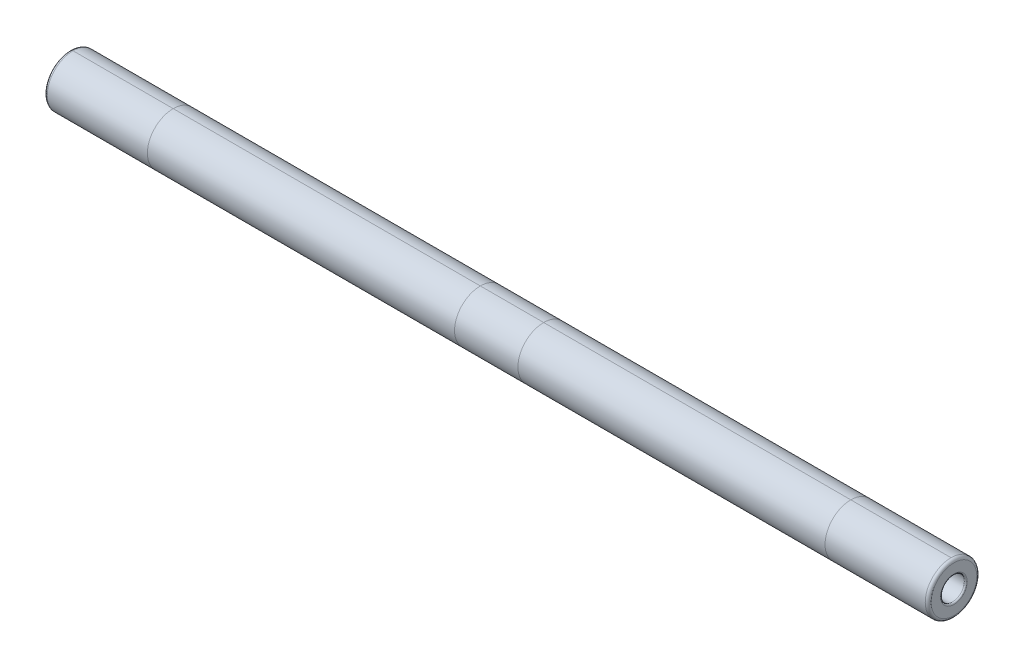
ISO-10303-21;
HEADER;
FILE_DESCRIPTION(('STEP AP214'),'2;1');
FILE_NAME('part.step','',(''),(''),'','','');
FILE_SCHEMA(('AUTOMOTIVE_DESIGN { 1 0 10303 214 1 1 1 1 }'));
ENDSEC;
DATA;
#1=APPLICATION_CONTEXT('core data for automotive mechanical design processes');
#2=APPLICATION_PROTOCOL_DEFINITION('international standard','automotive_design',2000,#1);
#3=PRODUCT_CONTEXT('',#1,'mechanical');
#4=PRODUCT('Part','Part','',(#3));
#5=PRODUCT_RELATED_PRODUCT_CATEGORY('part','',(#4));
#6=PRODUCT_DEFINITION_FORMATION('','',#4);
#7=PRODUCT_DEFINITION_CONTEXT('part definition',#1,'design');
#8=PRODUCT_DEFINITION('design','',#6,#7);
#9=PRODUCT_DEFINITION_SHAPE('','',#8);
#10=(LENGTH_UNIT() NAMED_UNIT(*) SI_UNIT(.MILLI.,.METRE.));
#11=(NAMED_UNIT(*) PLANE_ANGLE_UNIT() SI_UNIT($,.RADIAN.));
#12=(NAMED_UNIT(*) SI_UNIT($,.STERADIAN.) SOLID_ANGLE_UNIT());
#13=UNCERTAINTY_MEASURE_WITH_UNIT(LENGTH_MEASURE(1.E-05),#10,'distance_accuracy_value','');
#14=(GEOMETRIC_REPRESENTATION_CONTEXT(3) GLOBAL_UNCERTAINTY_ASSIGNED_CONTEXT((#13)) GLOBAL_UNIT_ASSIGNED_CONTEXT((#10,
#11,#12)) REPRESENTATION_CONTEXT('',''));
#15=CARTESIAN_POINT('',(0.,0.,0.));
#16=DIRECTION('',(0.,0.,1.));
#17=DIRECTION('',(1.,0.,0.));
#18=AXIS2_PLACEMENT_3D('',#15,#16,#17);
#19=CARTESIAN_POINT('',(-300.,0.,0.));
#20=DIRECTION('',(-1.,0.,0.));
#21=DIRECTION('',(0.,-1.,0.));
#22=AXIS2_PLACEMENT_3D('',#19,#20,#21);
#23=CYLINDRICAL_SURFACE('',#22,17.5);
#24=CARTESIAN_POINT('',(21.5,0.,0.));
#25=DIRECTION('',(-1.,0.,0.));
#26=DIRECTION('',(0.,-1.,0.));
#27=AXIS2_PLACEMENT_3D('',#24,#25,#26);
#28=CIRCLE('',#27,17.5);
#29=CARTESIAN_POINT('',(21.5,-17.4999999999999,0.));
#30=VERTEX_POINT('',#29);
#31=CARTESIAN_POINT('',(21.5,17.5000000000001,0.));
#32=VERTEX_POINT('',#31);
#33=EDGE_CURVE('E58',#30,#32,#28,.T.);
#34=ORIENTED_EDGE('',*,*,#33,.F.);
#35=DIRECTION('',(-1.,0.,0.));
#36=VECTOR('',#35,1.);
#37=CARTESIAN_POINT('',(-300.,-17.5,0.));
#38=LINE('',#37,#36);
#39=CARTESIAN_POINT('',(230.,-17.4999999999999,0.));
#40=VERTEX_POINT('',#39);
#41=EDGE_CURVE('E144',#40,#30,#38,.T.);
#42=ORIENTED_EDGE('',*,*,#41,.F.);
#43=CARTESIAN_POINT('',(230.,0.,0.));
#44=DIRECTION('',(1.,0.,0.));
#45=DIRECTION('',(0.,0.,-1.));
#46=AXIS2_PLACEMENT_3D('',#43,#44,#45);
#47=CIRCLE('',#46,17.5);
#48=CARTESIAN_POINT('',(230.,17.5000000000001,0.));
#49=VERTEX_POINT('',#48);
#50=EDGE_CURVE('E151',#49,#40,#47,.T.);
#51=ORIENTED_EDGE('',*,*,#50,.F.);
#52=DIRECTION('',(-1.,0.,0.));
#53=VECTOR('',#52,1.);
#54=CARTESIAN_POINT('',(-300.,17.5,0.));
#55=LINE('',#54,#53);
#56=EDGE_CURVE('E113',#49,#32,#55,.T.);
#57=ORIENTED_EDGE('',*,*,#56,.T.);
#58=EDGE_LOOP('',(#34,#42,#51,#57));
#59=FACE_BOUND('',#58,.T.);
#60=ADVANCED_FACE('F43',(#59),#23,.T.);
#61=CARTESIAN_POINT('',(21.5,0.,0.));
#62=DIRECTION('',(-1.,0.,0.));
#63=DIRECTION('',(0.,-1.,0.));
#64=AXIS2_PLACEMENT_3D('',#61,#62,#63);
#65=CIRCLE('',#64,17.5);
#66=EDGE_CURVE('E162',#32,#30,#65,.T.);
#67=ORIENTED_EDGE('',*,*,#66,.F.);
#68=ORIENTED_EDGE('',*,*,#56,.F.);
#69=CARTESIAN_POINT('',(230.,0.,0.));
#70=DIRECTION('',(1.,0.,0.));
#71=DIRECTION('',(0.,0.,-1.));
#72=AXIS2_PLACEMENT_3D('',#69,#70,#71);
#73=CIRCLE('',#72,17.5);
#74=EDGE_CURVE('E148',#40,#49,#73,.T.);
#75=ORIENTED_EDGE('',*,*,#74,.F.);
#76=ORIENTED_EDGE('',*,*,#41,.T.);
#77=EDGE_LOOP('',(#67,#68,#75,#76));
#78=FACE_BOUND('',#77,.T.);
#79=ADVANCED_FACE('F191',(#78),#23,.T.);
#80=CARTESIAN_POINT('',(-21.5,-17.5,0.));
#81=VERTEX_POINT('',#80);
#82=EDGE_CURVE('E145',#30,#81,#38,.T.);
#83=ORIENTED_EDGE('',*,*,#82,.F.);
#84=ORIENTED_EDGE('',*,*,#33,.T.);
#85=CARTESIAN_POINT('',(-21.5,17.5000000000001,0.));
#86=VERTEX_POINT('',#85);
#87=EDGE_CURVE('E138',#32,#86,#55,.T.);
#88=ORIENTED_EDGE('',*,*,#87,.T.);
#89=CARTESIAN_POINT('',(-21.5,0.,0.));
#90=DIRECTION('',(-1.,0.,0.));
#91=DIRECTION('',(0.,-1.,0.));
#92=AXIS2_PLACEMENT_3D('',#89,#90,#91);
#93=CIRCLE('',#92,17.5);
#94=EDGE_CURVE('E158',#81,#86,#93,.T.);
#95=ORIENTED_EDGE('',*,*,#94,.F.);
#96=EDGE_LOOP('',(#83,#84,#88,#95));
#97=FACE_BOUND('',#96,.T.);
#98=ADVANCED_FACE('F197',(#97),#23,.T.);
#99=ORIENTED_EDGE('',*,*,#87,.F.);
#100=ORIENTED_EDGE('',*,*,#66,.T.);
#101=ORIENTED_EDGE('',*,*,#82,.T.);
#102=CARTESIAN_POINT('',(-21.5,0.,0.));
#103=DIRECTION('',(-1.,0.,0.));
#104=DIRECTION('',(0.,-1.,0.));
#105=AXIS2_PLACEMENT_3D('',#102,#103,#104);
#106=CIRCLE('',#105,17.5);
#107=EDGE_CURVE('E154',#86,#81,#106,.T.);
#108=ORIENTED_EDGE('',*,*,#107,.F.);
#109=EDGE_LOOP('',(#99,#100,#101,#108));
#110=FACE_BOUND('',#109,.T.);
#111=ADVANCED_FACE('F324',(#110),#23,.T.);
#112=CARTESIAN_POINT('',(-230.,-17.5,0.));
#113=VERTEX_POINT('',#112);
#114=EDGE_CURVE('E414',#81,#113,#38,.T.);
#115=ORIENTED_EDGE('',*,*,#114,.F.);
#116=ORIENTED_EDGE('',*,*,#94,.T.);
#117=CARTESIAN_POINT('',(-230.,17.5,0.));
#118=VERTEX_POINT('',#117);
#119=EDGE_CURVE('E109',#86,#118,#55,.T.);
#120=ORIENTED_EDGE('',*,*,#119,.T.);
#121=CARTESIAN_POINT('',(-230.,0.,0.));
#122=DIRECTION('',(1.,0.,0.));
#123=DIRECTION('',(0.,0.,-1.));
#124=AXIS2_PLACEMENT_3D('',#121,#122,#123);
#125=CIRCLE('',#124,17.5);
#126=EDGE_CURVE('E104',#118,#113,#125,.T.);
#127=ORIENTED_EDGE('',*,*,#126,.T.);
#128=EDGE_LOOP('',(#115,#116,#120,#127));
#129=FACE_BOUND('',#128,.T.);
#130=ADVANCED_FACE('F334',(#129),#23,.T.);
#131=ORIENTED_EDGE('',*,*,#119,.F.);
#132=ORIENTED_EDGE('',*,*,#107,.T.);
#133=ORIENTED_EDGE('',*,*,#114,.T.);
#134=CARTESIAN_POINT('',(-230.,0.,0.));
#135=DIRECTION('',(1.,0.,0.));
#136=DIRECTION('',(0.,0.,-1.));
#137=AXIS2_PLACEMENT_3D('',#134,#135,#136);
#138=CIRCLE('',#137,17.5);
#139=EDGE_CURVE('E143',#113,#118,#138,.T.);
#140=ORIENTED_EDGE('',*,*,#139,.T.);
#141=EDGE_LOOP('',(#131,#132,#133,#140));
#142=FACE_BOUND('',#141,.T.);
#143=ADVANCED_FACE('F345',(#142),#23,.T.);
#144=ORIENTED_EDGE('',*,*,#126,.F.);
#145=CARTESIAN_POINT('',(-298.,17.5,0.));
#146=VERTEX_POINT('',#145);
#147=EDGE_CURVE('E97',#118,#146,#55,.T.);
#148=ORIENTED_EDGE('',*,*,#147,.T.);
#149=CARTESIAN_POINT('',(-298.,0.,0.));
#150=DIRECTION('',(1.,0.,0.));
#151=DIRECTION('',(0.,1.,0.));
#152=AXIS2_PLACEMENT_3D('',#149,#150,#151);
#153=CIRCLE('',#152,17.5);
#154=CARTESIAN_POINT('',(-298.,-17.5,0.));
#155=VERTEX_POINT('',#154);
#156=EDGE_CURVE('E102',#146,#155,#153,.T.);
#157=ORIENTED_EDGE('',*,*,#156,.T.);
#158=EDGE_CURVE('E117',#113,#155,#38,.T.);
#159=ORIENTED_EDGE('',*,*,#158,.F.);
#160=EDGE_LOOP('',(#144,#148,#157,#159));
#161=FACE_BOUND('',#160,.T.);
#162=ADVANCED_FACE('F99',(#161),#23,.T.);
#163=ORIENTED_EDGE('',*,*,#139,.F.);
#164=ORIENTED_EDGE('',*,*,#158,.T.);
#165=EDGE_CURVE('E115',#155,#146,#153,.T.);
#166=ORIENTED_EDGE('',*,*,#165,.T.);
#167=ORIENTED_EDGE('',*,*,#147,.F.);
#168=EDGE_LOOP('',(#163,#164,#166,#167));
#169=FACE_BOUND('',#168,.T.);
#170=ADVANCED_FACE('F116',(#169),#23,.T.);
#171=CARTESIAN_POINT('',(298.,17.5000000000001,0.));
#172=VERTEX_POINT('',#171);
#173=EDGE_CURVE('E112',#172,#49,#55,.T.);
#174=ORIENTED_EDGE('',*,*,#173,.T.);
#175=ORIENTED_EDGE('',*,*,#50,.T.);
#176=CARTESIAN_POINT('',(298.,-17.4999999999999,0.));
#177=VERTEX_POINT('',#176);
#178=EDGE_CURVE('E139',#177,#40,#38,.T.);
#179=ORIENTED_EDGE('',*,*,#178,.F.);
#180=CARTESIAN_POINT('',(298.,1.09850817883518E-13,0.));
#181=DIRECTION('',(-1.,0.,0.));
#182=DIRECTION('',(0.,-1.,0.));
#183=AXIS2_PLACEMENT_3D('',#180,#181,#182);
#184=CIRCLE('',#183,17.5);
#185=EDGE_CURVE('E125',#177,#172,#184,.T.);
#186=ORIENTED_EDGE('',*,*,#185,.T.);
#187=EDGE_LOOP('',(#174,#175,#179,#186));
#188=FACE_BOUND('',#187,.T.);
#189=ADVANCED_FACE('F205',(#188),#23,.T.);
#190=CARTESIAN_POINT('',(-300.,0.,0.));
#191=DIRECTION('',(1.,0.,0.));
#192=DIRECTION('',(0.,1.,0.));
#193=AXIS2_PLACEMENT_3D('',#190,#191,#192);
#194=PLANE('',#193);
#195=CARTESIAN_POINT('',(-300.,0.,0.));
#196=DIRECTION('',(1.,0.,0.));
#197=DIRECTION('',(0.,1.,0.));
#198=AXIS2_PLACEMENT_3D('',#195,#196,#197);
#199=CIRCLE('',#198,9.);
#200=CARTESIAN_POINT('',(-300.,8.99999999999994,0.));
#201=VERTEX_POINT('',#200);
#202=EDGE_CURVE('E173',#201,#201,#199,.T.);
#203=ORIENTED_EDGE('',*,*,#202,.T.);
#204=EDGE_LOOP('',(#203));
#205=FACE_BOUND('',#204,.T.);
#206=CARTESIAN_POINT('',(-300.,0.,0.));
#207=DIRECTION('',(1.,0.,0.));
#208=DIRECTION('',(0.,1.,0.));
#209=AXIS2_PLACEMENT_3D('',#206,#207,#208);
#210=CIRCLE('',#209,15.5);
#211=CARTESIAN_POINT('',(-300.,15.5,0.));
#212=VERTEX_POINT('',#211);
#213=EDGE_CURVE('E110',#212,#212,#210,.F.);
#214=ORIENTED_EDGE('',*,*,#213,.T.);
#215=EDGE_LOOP('',(#214));
#216=FACE_BOUND('',#215,.T.);
#217=ADVANCED_FACE('F203',(#205,#216),#194,.F.);
#218=ORIENTED_EDGE('',*,*,#178,.T.);
#219=ORIENTED_EDGE('',*,*,#74,.T.);
#220=ORIENTED_EDGE('',*,*,#173,.F.);
#221=EDGE_CURVE('E123',#172,#177,#184,.T.);
#222=ORIENTED_EDGE('',*,*,#221,.T.);
#223=EDGE_LOOP('',(#218,#219,#220,#222));
#224=FACE_BOUND('',#223,.T.);
#225=ADVANCED_FACE('F193',(#224),#23,.T.);
#226=CARTESIAN_POINT('',(300.,17.5000000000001,0.));
#227=DIRECTION('',(-1.,0.,0.));
#228=DIRECTION('',(0.,-1.,0.));
#229=AXIS2_PLACEMENT_3D('',#226,#227,#228);
#230=PLANE('',#229);
#231=CARTESIAN_POINT('',(300.,0.,0.));
#232=DIRECTION('',(-1.,0.,0.));
#233=DIRECTION('',(0.,-1.,0.));
#234=AXIS2_PLACEMENT_3D('',#231,#232,#233);
#235=CIRCLE('',#234,9.);
#236=CARTESIAN_POINT('',(300.,-8.99999999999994,0.));
#237=VERTEX_POINT('',#236);
#238=EDGE_CURVE('E11',#237,#237,#235,.T.);
#239=ORIENTED_EDGE('',*,*,#238,.T.);
#240=EDGE_LOOP('',(#239));
#241=FACE_BOUND('',#240,.T.);
#242=CARTESIAN_POINT('',(300.,1.10218211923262E-13,0.));
#243=DIRECTION('',(-1.,0.,0.));
#244=DIRECTION('',(0.,-1.,0.));
#245=AXIS2_PLACEMENT_3D('',#242,#243,#244);
#246=CIRCLE('',#245,15.5);
#247=CARTESIAN_POINT('',(300.,-15.4999999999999,0.));
#248=VERTEX_POINT('',#247);
#249=EDGE_CURVE('E131',#248,#248,#246,.F.);
#250=ORIENTED_EDGE('',*,*,#249,.T.);
#251=EDGE_LOOP('',(#250));
#252=FACE_BOUND('',#251,.T.);
#253=ADVANCED_FACE('F202',(#241,#252),#230,.F.);
#254=CARTESIAN_POINT('',(298.,1.09850817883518E-13,0.));
#255=DIRECTION('',(-1.,0.,0.));
#256=DIRECTION('',(0.,-1.,0.));
#257=AXIS2_PLACEMENT_3D('',#254,#255,#256);
#258=TOROIDAL_SURFACE('',#257,15.5,2.);
#259=ORIENTED_EDGE('',*,*,#249,.F.);
#260=EDGE_LOOP('',(#259));
#261=FACE_BOUND('',#260,.T.);
#262=ORIENTED_EDGE('',*,*,#185,.F.);
#263=ORIENTED_EDGE('',*,*,#221,.F.);
#264=EDGE_LOOP('',(#262,#263));
#265=FACE_BOUND('',#264,.T.);
#266=ADVANCED_FACE('F210',(#261,#265),#258,.T.);
#267=CARTESIAN_POINT('',(-298.,0.,0.));
#268=DIRECTION('',(1.,0.,0.));
#269=DIRECTION('',(0.,1.,0.));
#270=AXIS2_PLACEMENT_3D('',#267,#268,#269);
#271=TOROIDAL_SURFACE('',#270,15.5,2.);
#272=ORIENTED_EDGE('',*,*,#156,.F.);
#273=ORIENTED_EDGE('',*,*,#165,.F.);
#274=EDGE_LOOP('',(#272,#273));
#275=FACE_BOUND('',#274,.T.);
#276=ORIENTED_EDGE('',*,*,#213,.F.);
#277=EDGE_LOOP('',(#276));
#278=FACE_BOUND('',#277,.T.);
#279=ADVANCED_FACE('F121',(#275,#278),#271,.T.);
#280=CARTESIAN_POINT('',(-225.,0.,0.));
#281=DIRECTION('',(-1.,0.,0.));
#282=DIRECTION('',(0.,-1.,0.));
#283=AXIS2_PLACEMENT_3D('',#280,#281,#282);
#284=CYLINDRICAL_SURFACE('',#283,8.);
#285=CARTESIAN_POINT('',(-299.,0.,0.));
#286=DIRECTION('',(1.,0.,0.));
#287=DIRECTION('',(0.,1.,0.));
#288=AXIS2_PLACEMENT_3D('',#285,#286,#287);
#289=CIRCLE('',#288,8.);
#290=CARTESIAN_POINT('',(-299.,7.99999999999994,0.));
#291=VERTEX_POINT('',#290);
#292=EDGE_CURVE('E168',#291,#291,#289,.F.);
#293=ORIENTED_EDGE('',*,*,#292,.T.);
#294=EDGE_LOOP('',(#293));
#295=FACE_BOUND('',#294,.T.);
#296=CARTESIAN_POINT('',(-225.,0.,0.));
#297=DIRECTION('',(-1.,0.,0.));
#298=DIRECTION('',(0.,-1.,0.));
#299=AXIS2_PLACEMENT_3D('',#296,#297,#298);
#300=CIRCLE('',#299,8.);
#301=CARTESIAN_POINT('',(-225.,-8.00000000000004,0.));
#302=VERTEX_POINT('',#301);
#303=EDGE_CURVE('E119',#302,#302,#300,.T.);
#304=ORIENTED_EDGE('',*,*,#303,.F.);
#305=EDGE_LOOP('',(#304));
#306=FACE_BOUND('',#305,.T.);
#307=ADVANCED_FACE('F229',(#295,#306),#284,.F.);
#308=CARTESIAN_POINT('',(-225.,0.,0.));
#309=DIRECTION('',(-1.,0.,0.));
#310=DIRECTION('',(0.,-1.,0.));
#311=AXIS2_PLACEMENT_3D('',#308,#309,#310);
#312=PLANE('',#311);
#313=ORIENTED_EDGE('',*,*,#303,.T.);
#314=EDGE_LOOP('',(#313));
#315=FACE_BOUND('',#314,.T.);
#316=ADVANCED_FACE('F236',(#315),#312,.T.);
#317=CARTESIAN_POINT('',(225.,0.,0.));
#318=DIRECTION('',(1.,0.,0.));
#319=DIRECTION('',(0.,1.,0.));
#320=AXIS2_PLACEMENT_3D('',#317,#318,#319);
#321=CYLINDRICAL_SURFACE('',#320,8.);
#322=CARTESIAN_POINT('',(299.,0.,0.));
#323=DIRECTION('',(-1.,0.,0.));
#324=DIRECTION('',(0.,-1.,0.));
#325=AXIS2_PLACEMENT_3D('',#322,#323,#324);
#326=CIRCLE('',#325,8.);
#327=CARTESIAN_POINT('',(299.,-7.99999999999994,0.));
#328=VERTEX_POINT('',#327);
#329=EDGE_CURVE('E51',#328,#328,#326,.F.);
#330=ORIENTED_EDGE('',*,*,#329,.T.);
#331=EDGE_LOOP('',(#330));
#332=FACE_BOUND('',#331,.T.);
#333=CARTESIAN_POINT('',(225.,0.,0.));
#334=DIRECTION('',(1.,0.,0.));
#335=DIRECTION('',(0.,1.,0.));
#336=AXIS2_PLACEMENT_3D('',#333,#334,#335);
#337=CIRCLE('',#336,8.);
#338=CARTESIAN_POINT('',(225.,8.00000000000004,0.));
#339=VERTEX_POINT('',#338);
#340=EDGE_CURVE('E254',#339,#339,#337,.T.);
#341=ORIENTED_EDGE('',*,*,#340,.F.);
#342=EDGE_LOOP('',(#341));
#343=FACE_BOUND('',#342,.T.);
#344=ADVANCED_FACE('F178',(#332,#343),#321,.F.);
#345=CARTESIAN_POINT('',(225.,0.,0.));
#346=DIRECTION('',(1.,0.,0.));
#347=DIRECTION('',(0.,1.,0.));
#348=AXIS2_PLACEMENT_3D('',#345,#346,#347);
#349=PLANE('',#348);
#350=ORIENTED_EDGE('',*,*,#340,.T.);
#351=EDGE_LOOP('',(#350));
#352=FACE_BOUND('',#351,.T.);
#353=ADVANCED_FACE('F187',(#352),#349,.T.);
#354=CARTESIAN_POINT('',(-299.,0.,0.));
#355=DIRECTION('',(1.,0.,0.));
#356=DIRECTION('',(0.,1.,0.));
#357=AXIS2_PLACEMENT_3D('',#354,#355,#356);
#358=TOROIDAL_SURFACE('',#357,9.,1.);
#359=ORIENTED_EDGE('',*,*,#202,.F.);
#360=EDGE_LOOP('',(#359));
#361=FACE_BOUND('',#360,.T.);
#362=ORIENTED_EDGE('',*,*,#292,.F.);
#363=EDGE_LOOP('',(#362));
#364=FACE_BOUND('',#363,.T.);
#365=ADVANCED_FACE('F182',(#361,#364),#358,.T.);
#366=CARTESIAN_POINT('',(299.,0.,0.));
#367=DIRECTION('',(-1.,0.,0.));
#368=DIRECTION('',(0.,-1.,0.));
#369=AXIS2_PLACEMENT_3D('',#366,#367,#368);
#370=TOROIDAL_SURFACE('',#369,9.,1.);
#371=ORIENTED_EDGE('',*,*,#238,.F.);
#372=EDGE_LOOP('',(#371));
#373=FACE_BOUND('',#372,.T.);
#374=ORIENTED_EDGE('',*,*,#329,.F.);
#375=EDGE_LOOP('',(#374));
#376=FACE_BOUND('',#375,.T.);
#377=ADVANCED_FACE('F45',(#373,#376),#370,.T.);
#378=CLOSED_SHELL('',(#60,#79,#98,#111,#130,#143,#162,#170,#189,#217,#225,#253,#266,#279,#307,
#316,#344,#353,#365,#377));
#379=MANIFOLD_SOLID_BREP('B2',#378);
#380=ADVANCED_BREP_SHAPE_REPRESENTATION('',(#18,#379),#14);
#381=SHAPE_DEFINITION_REPRESENTATION(#9,#380);
ENDSEC;
END-ISO-10303-21;
